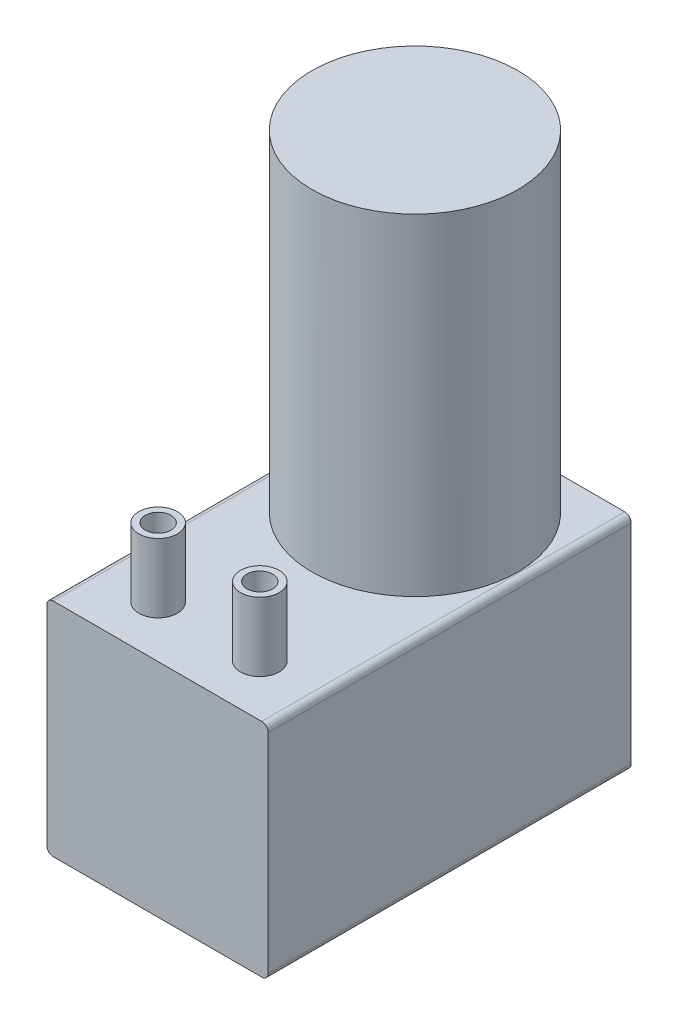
ISO-10303-21;
HEADER;
FILE_DESCRIPTION(('STEP AP214'),'2;1');
FILE_NAME('part.step','',(''),(''),'','','');
FILE_SCHEMA(('AUTOMOTIVE_DESIGN { 1 0 10303 214 1 1 1 1 }'));
ENDSEC;
DATA;
#1=APPLICATION_CONTEXT('core data for automotive mechanical design processes');
#2=APPLICATION_PROTOCOL_DEFINITION('international standard','automotive_design',2000,#1);
#3=PRODUCT_CONTEXT('',#1,'mechanical');
#4=PRODUCT('Part','Part','',(#3));
#5=PRODUCT_RELATED_PRODUCT_CATEGORY('part','',(#4));
#6=PRODUCT_DEFINITION_FORMATION('','',#4);
#7=PRODUCT_DEFINITION_CONTEXT('part definition',#1,'design');
#8=PRODUCT_DEFINITION('design','',#6,#7);
#9=PRODUCT_DEFINITION_SHAPE('','',#8);
#10=(LENGTH_UNIT() NAMED_UNIT(*) SI_UNIT(.MILLI.,.METRE.));
#11=(NAMED_UNIT(*) PLANE_ANGLE_UNIT() SI_UNIT($,.RADIAN.));
#12=(NAMED_UNIT(*) SI_UNIT($,.STERADIAN.) SOLID_ANGLE_UNIT());
#13=UNCERTAINTY_MEASURE_WITH_UNIT(LENGTH_MEASURE(1.E-05),#10,'distance_accuracy_value','');
#14=(GEOMETRIC_REPRESENTATION_CONTEXT(3) GLOBAL_UNCERTAINTY_ASSIGNED_CONTEXT((#13)) GLOBAL_UNIT_ASSIGNED_CONTEXT((#10,
#11,#12)) REPRESENTATION_CONTEXT('',''));
#15=CARTESIAN_POINT('',(0.,0.,0.));
#16=DIRECTION('',(0.,0.,1.));
#17=DIRECTION('',(1.,0.,0.));
#18=AXIS2_PLACEMENT_3D('',#15,#16,#17);
#19=CARTESIAN_POINT('',(0.5,0.5,28.2));
#20=DIRECTION('',(0.,0.,1.));
#21=DIRECTION('',(1.,0.,0.));
#22=AXIS2_PLACEMENT_3D('',#19,#20,#21);
#23=CYLINDRICAL_SURFACE('',#22,0.5);
#24=DIRECTION('',(0.,0.,1.));
#25=VECTOR('',#24,1.);
#26=CARTESIAN_POINT('',(0.,0.5,28.2));
#27=LINE('',#26,#25);
#28=CARTESIAN_POINT('',(0.,0.5,0.));
#29=VERTEX_POINT('',#28);
#30=CARTESIAN_POINT('',(0.,0.5,28.2));
#31=VERTEX_POINT('',#30);
#32=EDGE_CURVE('E151',#29,#31,#27,.T.);
#33=ORIENTED_EDGE('',*,*,#32,.F.);
#34=CARTESIAN_POINT('',(0.5,0.5,0.));
#35=DIRECTION('',(0.,0.,-1.));
#36=DIRECTION('',(-1.,0.,0.));
#37=AXIS2_PLACEMENT_3D('',#34,#35,#36);
#38=CIRCLE('',#37,0.5);
#39=CARTESIAN_POINT('',(0.5,0.,0.));
#40=VERTEX_POINT('',#39);
#41=EDGE_CURVE('E40',#40,#29,#38,.T.);
#42=ORIENTED_EDGE('',*,*,#41,.F.);
#43=DIRECTION('',(0.,0.,1.));
#44=VECTOR('',#43,1.);
#45=CARTESIAN_POINT('',(0.5,0.,28.2));
#46=LINE('',#45,#44);
#47=CARTESIAN_POINT('',(0.5,0.,28.2));
#48=VERTEX_POINT('',#47);
#49=EDGE_CURVE('E154',#48,#40,#46,.F.);
#50=ORIENTED_EDGE('',*,*,#49,.F.);
#51=CARTESIAN_POINT('',(0.5,0.5,28.2));
#52=DIRECTION('',(0.,0.,-1.));
#53=DIRECTION('',(-1.,0.,0.));
#54=AXIS2_PLACEMENT_3D('',#51,#52,#53);
#55=CIRCLE('',#54,0.5);
#56=EDGE_CURVE('E11',#31,#48,#55,.F.);
#57=ORIENTED_EDGE('',*,*,#56,.F.);
#58=EDGE_LOOP('',(#33,#42,#50,#57));
#59=FACE_BOUND('',#58,.T.);
#60=ADVANCED_FACE('F33',(#59),#23,.T.);
#61=CARTESIAN_POINT('',(16.7,0.5,28.2));
#62=DIRECTION('',(0.,0.,-1.));
#63=DIRECTION('',(-1.,0.,0.));
#64=AXIS2_PLACEMENT_3D('',#61,#62,#63);
#65=CYLINDRICAL_SURFACE('',#64,0.5);
#66=DIRECTION('',(0.,0.,-1.));
#67=VECTOR('',#66,1.);
#68=CARTESIAN_POINT('',(17.2,0.5,28.2));
#69=LINE('',#68,#67);
#70=CARTESIAN_POINT('',(17.2,0.5,28.2));
#71=VERTEX_POINT('',#70);
#72=CARTESIAN_POINT('',(17.2,0.5,0.));
#73=VERTEX_POINT('',#72);
#74=EDGE_CURVE('E140',#71,#73,#69,.T.);
#75=ORIENTED_EDGE('',*,*,#74,.F.);
#76=CARTESIAN_POINT('',(16.7,0.5,28.2));
#77=DIRECTION('',(0.,0.,-1.));
#78=DIRECTION('',(-1.,0.,0.));
#79=AXIS2_PLACEMENT_3D('',#76,#77,#78);
#80=CIRCLE('',#79,0.5);
#81=CARTESIAN_POINT('',(16.7,0.,28.2));
#82=VERTEX_POINT('',#81);
#83=EDGE_CURVE('E146',#82,#71,#80,.F.);
#84=ORIENTED_EDGE('',*,*,#83,.F.);
#85=DIRECTION('',(0.,0.,-1.));
#86=VECTOR('',#85,1.);
#87=CARTESIAN_POINT('',(16.7,0.,28.2));
#88=LINE('',#87,#86);
#89=CARTESIAN_POINT('',(16.7,0.,0.));
#90=VERTEX_POINT('',#89);
#91=EDGE_CURVE('E143',#90,#82,#88,.F.);
#92=ORIENTED_EDGE('',*,*,#91,.F.);
#93=CARTESIAN_POINT('',(16.7,0.5,0.));
#94=DIRECTION('',(0.,0.,-1.));
#95=DIRECTION('',(-1.,0.,0.));
#96=AXIS2_PLACEMENT_3D('',#93,#94,#95);
#97=CIRCLE('',#96,0.5);
#98=EDGE_CURVE('E148',#73,#90,#97,.T.);
#99=ORIENTED_EDGE('',*,*,#98,.F.);
#100=EDGE_LOOP('',(#75,#84,#92,#99));
#101=FACE_BOUND('',#100,.T.);
#102=ADVANCED_FACE('F195',(#101),#65,.T.);
#103=CARTESIAN_POINT('',(16.7,16.7,28.2));
#104=DIRECTION('',(0.,0.,-1.));
#105=DIRECTION('',(-1.,0.,0.));
#106=AXIS2_PLACEMENT_3D('',#103,#104,#105);
#107=CYLINDRICAL_SURFACE('',#106,0.5);
#108=DIRECTION('',(0.,0.,-1.));
#109=VECTOR('',#108,1.);
#110=CARTESIAN_POINT('',(16.7,17.2,28.2));
#111=LINE('',#110,#109);
#112=CARTESIAN_POINT('',(16.7,17.2,28.2));
#113=VERTEX_POINT('',#112);
#114=CARTESIAN_POINT('',(16.7,17.2,0.));
#115=VERTEX_POINT('',#114);
#116=EDGE_CURVE('E103',#113,#115,#111,.T.);
#117=ORIENTED_EDGE('',*,*,#116,.F.);
#118=CARTESIAN_POINT('',(16.7,16.7,28.2));
#119=DIRECTION('',(0.,0.,-1.));
#120=DIRECTION('',(-1.,0.,0.));
#121=AXIS2_PLACEMENT_3D('',#118,#119,#120);
#122=CIRCLE('',#121,0.5);
#123=CARTESIAN_POINT('',(17.2,16.7,28.2));
#124=VERTEX_POINT('',#123);
#125=EDGE_CURVE('E136',#124,#113,#122,.F.);
#126=ORIENTED_EDGE('',*,*,#125,.F.);
#127=DIRECTION('',(0.,0.,-1.));
#128=VECTOR('',#127,1.);
#129=CARTESIAN_POINT('',(17.2,16.7,28.2));
#130=LINE('',#129,#128);
#131=CARTESIAN_POINT('',(17.2,16.7,0.));
#132=VERTEX_POINT('',#131);
#133=EDGE_CURVE('E133',#132,#124,#130,.F.);
#134=ORIENTED_EDGE('',*,*,#133,.F.);
#135=CARTESIAN_POINT('',(16.7,16.7,0.));
#136=DIRECTION('',(0.,0.,-1.));
#137=DIRECTION('',(-1.,0.,0.));
#138=AXIS2_PLACEMENT_3D('',#135,#136,#137);
#139=CIRCLE('',#138,0.5);
#140=EDGE_CURVE('E138',#115,#132,#139,.T.);
#141=ORIENTED_EDGE('',*,*,#140,.F.);
#142=EDGE_LOOP('',(#117,#126,#134,#141));
#143=FACE_BOUND('',#142,.T.);
#144=ADVANCED_FACE('F190',(#143),#107,.T.);
#145=CARTESIAN_POINT('',(0.5,16.7,28.2));
#146=DIRECTION('',(0.,0.,1.));
#147=DIRECTION('',(1.,0.,0.));
#148=AXIS2_PLACEMENT_3D('',#145,#146,#147);
#149=CYLINDRICAL_SURFACE('',#148,0.5);
#150=DIRECTION('',(0.,0.,1.));
#151=VECTOR('',#150,1.);
#152=CARTESIAN_POINT('',(0.5,17.2,28.2));
#153=LINE('',#152,#151);
#154=CARTESIAN_POINT('',(0.5,17.2,0.));
#155=VERTEX_POINT('',#154);
#156=CARTESIAN_POINT('',(0.5,17.2,28.2));
#157=VERTEX_POINT('',#156);
#158=EDGE_CURVE('E101',#155,#157,#153,.T.);
#159=ORIENTED_EDGE('',*,*,#158,.F.);
#160=CARTESIAN_POINT('',(0.5,16.7,0.));
#161=DIRECTION('',(0.,0.,-1.));
#162=DIRECTION('',(-1.,0.,0.));
#163=AXIS2_PLACEMENT_3D('',#160,#161,#162);
#164=CIRCLE('',#163,0.5);
#165=CARTESIAN_POINT('',(0.,16.7,0.));
#166=VERTEX_POINT('',#165);
#167=EDGE_CURVE('E110',#166,#155,#164,.T.);
#168=ORIENTED_EDGE('',*,*,#167,.F.);
#169=DIRECTION('',(0.,0.,1.));
#170=VECTOR('',#169,1.);
#171=CARTESIAN_POINT('',(0.,16.7,28.2));
#172=LINE('',#171,#170);
#173=CARTESIAN_POINT('',(0.,16.7,28.2));
#174=VERTEX_POINT('',#173);
#175=EDGE_CURVE('E119',#174,#166,#172,.F.);
#176=ORIENTED_EDGE('',*,*,#175,.F.);
#177=CARTESIAN_POINT('',(0.5,16.7,28.2));
#178=DIRECTION('',(0.,0.,-1.));
#179=DIRECTION('',(-1.,0.,0.));
#180=AXIS2_PLACEMENT_3D('',#177,#178,#179);
#181=CIRCLE('',#180,0.5);
#182=EDGE_CURVE('E118',#157,#174,#181,.F.);
#183=ORIENTED_EDGE('',*,*,#182,.F.);
#184=EDGE_LOOP('',(#159,#168,#176,#183));
#185=FACE_BOUND('',#184,.T.);
#186=ADVANCED_FACE('F122',(#185),#149,.T.);
#187=CARTESIAN_POINT('',(0.,17.2,28.2));
#188=DIRECTION('',(0.,-1.,0.));
#189=DIRECTION('',(0.,0.,-1.));
#190=AXIS2_PLACEMENT_3D('',#187,#188,#189);
#191=PLANE('',#190);
#192=CARTESIAN_POINT('',(12.55,17.2,24.2));
#193=DIRECTION('',(0.,-1.,0.));
#194=DIRECTION('',(0.,0.,-1.));
#195=AXIS2_PLACEMENT_3D('',#192,#193,#194);
#196=CIRCLE('',#195,1.5);
#197=CARTESIAN_POINT('',(12.55,17.2,22.7));
#198=VERTEX_POINT('',#197);
#199=EDGE_CURVE('E127',#198,#198,#196,.F.);
#200=ORIENTED_EDGE('',*,*,#199,.F.);
#201=EDGE_LOOP('',(#200));
#202=FACE_BOUND('',#201,.T.);
#203=DIRECTION('',(-1.,0.,0.));
#204=VECTOR('',#203,1.);
#205=CARTESIAN_POINT('',(0.,17.2,28.2));
#206=LINE('',#205,#204);
#207=EDGE_CURVE('E173',#113,#157,#206,.T.);
#208=ORIENTED_EDGE('',*,*,#207,.F.);
#209=ORIENTED_EDGE('',*,*,#116,.T.);
#210=DIRECTION('',(-1.,0.,0.));
#211=VECTOR('',#210,1.);
#212=CARTESIAN_POINT('',(0.,17.2,0.));
#213=LINE('',#212,#211);
#214=EDGE_CURVE('E95',#115,#155,#213,.T.);
#215=ORIENTED_EDGE('',*,*,#214,.T.);
#216=ORIENTED_EDGE('',*,*,#158,.T.);
#217=EDGE_LOOP('',(#208,#209,#215,#216));
#218=FACE_BOUND('',#217,.T.);
#219=CARTESIAN_POINT('',(8.6,17.2,8.2));
#220=DIRECTION('',(0.,-1.,0.));
#221=DIRECTION('',(0.,0.,-1.));
#222=AXIS2_PLACEMENT_3D('',#219,#220,#221);
#223=CIRCLE('',#222,8.);
#224=CARTESIAN_POINT('',(8.6,17.2,0.199999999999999));
#225=VERTEX_POINT('',#224);
#226=EDGE_CURVE('E175',#225,#225,#223,.F.);
#227=ORIENTED_EDGE('',*,*,#226,.F.);
#228=EDGE_LOOP('',(#227));
#229=FACE_BOUND('',#228,.T.);
#230=CARTESIAN_POINT('',(4.65,17.2,24.2));
#231=DIRECTION('',(0.,-1.,0.));
#232=DIRECTION('',(0.,0.,-1.));
#233=AXIS2_PLACEMENT_3D('',#230,#231,#232);
#234=CIRCLE('',#233,1.5);
#235=CARTESIAN_POINT('',(4.65,17.2,22.7));
#236=VERTEX_POINT('',#235);
#237=EDGE_CURVE('E123',#236,#236,#234,.F.);
#238=ORIENTED_EDGE('',*,*,#237,.F.);
#239=EDGE_LOOP('',(#238));
#240=FACE_BOUND('',#239,.T.);
#241=ADVANCED_FACE('F98',(#202,#218,#229,#240),#191,.F.);
#242=CARTESIAN_POINT('',(0.,0.,28.2));
#243=DIRECTION('',(1.,0.,0.));
#244=DIRECTION('',(0.,0.,-1.));
#245=AXIS2_PLACEMENT_3D('',#242,#243,#244);
#246=PLANE('',#245);
#247=DIRECTION('',(0.,-1.,0.));
#248=VECTOR('',#247,1.);
#249=CARTESIAN_POINT('',(0.,0.,0.));
#250=LINE('',#249,#248);
#251=EDGE_CURVE('E114',#166,#29,#250,.T.);
#252=ORIENTED_EDGE('',*,*,#251,.T.);
#253=ORIENTED_EDGE('',*,*,#32,.T.);
#254=DIRECTION('',(0.,-1.,0.));
#255=VECTOR('',#254,1.);
#256=CARTESIAN_POINT('',(0.,0.,28.2));
#257=LINE('',#256,#255);
#258=EDGE_CURVE('E106',#174,#31,#257,.T.);
#259=ORIENTED_EDGE('',*,*,#258,.F.);
#260=ORIENTED_EDGE('',*,*,#175,.T.);
#261=EDGE_LOOP('',(#252,#253,#259,#260));
#262=FACE_BOUND('',#261,.T.);
#263=ADVANCED_FACE('F158',(#262),#246,.F.);
#264=CARTESIAN_POINT('',(0.,0.,28.2));
#265=DIRECTION('',(0.,1.,0.));
#266=DIRECTION('',(0.,0.,1.));
#267=AXIS2_PLACEMENT_3D('',#264,#265,#266);
#268=PLANE('',#267);
#269=DIRECTION('',(1.,0.,0.));
#270=VECTOR('',#269,1.);
#271=CARTESIAN_POINT('',(0.,0.,28.2));
#272=LINE('',#271,#270);
#273=EDGE_CURVE('E169',#48,#82,#272,.T.);
#274=ORIENTED_EDGE('',*,*,#273,.F.);
#275=ORIENTED_EDGE('',*,*,#49,.T.);
#276=DIRECTION('',(1.,0.,0.));
#277=VECTOR('',#276,1.);
#278=CARTESIAN_POINT('',(0.,0.,0.));
#279=LINE('',#278,#277);
#280=EDGE_CURVE('E155',#40,#90,#279,.T.);
#281=ORIENTED_EDGE('',*,*,#280,.T.);
#282=ORIENTED_EDGE('',*,*,#91,.T.);
#283=EDGE_LOOP('',(#274,#275,#281,#282));
#284=FACE_BOUND('',#283,.T.);
#285=ADVANCED_FACE('F188',(#284),#268,.F.);
#286=CARTESIAN_POINT('',(17.2,0.,28.2));
#287=DIRECTION('',(-1.,0.,0.));
#288=DIRECTION('',(0.,0.,1.));
#289=AXIS2_PLACEMENT_3D('',#286,#287,#288);
#290=PLANE('',#289);
#291=DIRECTION('',(0.,1.,0.));
#292=VECTOR('',#291,1.);
#293=CARTESIAN_POINT('',(17.2,0.,28.2));
#294=LINE('',#293,#292);
#295=EDGE_CURVE('E171',#71,#124,#294,.T.);
#296=ORIENTED_EDGE('',*,*,#295,.F.);
#297=ORIENTED_EDGE('',*,*,#74,.T.);
#298=DIRECTION('',(0.,1.,0.));
#299=VECTOR('',#298,1.);
#300=CARTESIAN_POINT('',(17.2,0.,0.));
#301=LINE('',#300,#299);
#302=EDGE_CURVE('E107',#73,#132,#301,.T.);
#303=ORIENTED_EDGE('',*,*,#302,.T.);
#304=ORIENTED_EDGE('',*,*,#133,.T.);
#305=EDGE_LOOP('',(#296,#297,#303,#304));
#306=FACE_BOUND('',#305,.T.);
#307=ADVANCED_FACE('F208',(#306),#290,.F.);
#308=CARTESIAN_POINT('',(0.,17.2,28.2));
#309=DIRECTION('',(0.,0.,-1.));
#310=DIRECTION('',(-1.,0.,0.));
#311=AXIS2_PLACEMENT_3D('',#308,#309,#310);
#312=PLANE('',#311);
#313=ORIENTED_EDGE('',*,*,#258,.T.);
#314=ORIENTED_EDGE('',*,*,#56,.T.);
#315=ORIENTED_EDGE('',*,*,#273,.T.);
#316=ORIENTED_EDGE('',*,*,#83,.T.);
#317=ORIENTED_EDGE('',*,*,#295,.T.);
#318=ORIENTED_EDGE('',*,*,#125,.T.);
#319=ORIENTED_EDGE('',*,*,#207,.T.);
#320=ORIENTED_EDGE('',*,*,#182,.T.);
#321=EDGE_LOOP('',(#313,#314,#315,#316,#317,#318,#319,#320));
#322=FACE_BOUND('',#321,.T.);
#323=ADVANCED_FACE('F211',(#322),#312,.F.);
#324=CARTESIAN_POINT('',(0.,17.2,0.));
#325=DIRECTION('',(0.,0.,-1.));
#326=DIRECTION('',(-1.,0.,0.));
#327=AXIS2_PLACEMENT_3D('',#324,#325,#326);
#328=PLANE('',#327);
#329=ORIENTED_EDGE('',*,*,#280,.F.);
#330=ORIENTED_EDGE('',*,*,#41,.T.);
#331=ORIENTED_EDGE('',*,*,#251,.F.);
#332=ORIENTED_EDGE('',*,*,#167,.T.);
#333=ORIENTED_EDGE('',*,*,#214,.F.);
#334=ORIENTED_EDGE('',*,*,#140,.T.);
#335=ORIENTED_EDGE('',*,*,#302,.F.);
#336=ORIENTED_EDGE('',*,*,#98,.T.);
#337=EDGE_LOOP('',(#329,#330,#331,#332,#333,#334,#335,#336));
#338=FACE_BOUND('',#337,.T.);
#339=ADVANCED_FACE('F112',(#338),#328,.T.);
#340=CARTESIAN_POINT('',(8.6,42.93,8.2));
#341=DIRECTION('',(0.,-1.,0.));
#342=DIRECTION('',(0.,0.,-1.));
#343=AXIS2_PLACEMENT_3D('',#340,#341,#342);
#344=CYLINDRICAL_SURFACE('',#343,8.);
#345=CARTESIAN_POINT('',(8.6,42.93,8.2));
#346=DIRECTION('',(0.,1.,0.));
#347=DIRECTION('',(0.,0.,1.));
#348=AXIS2_PLACEMENT_3D('',#345,#346,#347);
#349=CIRCLE('',#348,8.);
#350=CARTESIAN_POINT('',(8.6,42.93,16.2));
#351=VERTEX_POINT('',#350);
#352=EDGE_CURVE('E159',#351,#351,#349,.T.);
#353=ORIENTED_EDGE('',*,*,#352,.F.);
#354=EDGE_LOOP('',(#353));
#355=FACE_BOUND('',#354,.T.);
#356=ORIENTED_EDGE('',*,*,#226,.T.);
#357=EDGE_LOOP('',(#356));
#358=FACE_BOUND('',#357,.T.);
#359=ADVANCED_FACE('F226',(#355,#358),#344,.T.);
#360=CARTESIAN_POINT('',(8.6,42.93,8.2));
#361=DIRECTION('',(0.,1.,0.));
#362=DIRECTION('',(0.,0.,1.));
#363=AXIS2_PLACEMENT_3D('',#360,#361,#362);
#364=PLANE('',#363);
#365=ORIENTED_EDGE('',*,*,#352,.T.);
#366=EDGE_LOOP('',(#365));
#367=FACE_BOUND('',#366,.T.);
#368=ADVANCED_FACE('F231',(#367),#364,.T.);
#369=CARTESIAN_POINT('',(12.55,22.54,24.2));
#370=DIRECTION('',(0.,-1.,0.));
#371=DIRECTION('',(0.,0.,-1.));
#372=AXIS2_PLACEMENT_3D('',#369,#370,#371);
#373=CYLINDRICAL_SURFACE('',#372,1.5);
#374=CARTESIAN_POINT('',(12.55,22.54,24.2));
#375=DIRECTION('',(0.,1.,0.));
#376=DIRECTION('',(0.,0.,1.));
#377=AXIS2_PLACEMENT_3D('',#374,#375,#376);
#378=CIRCLE('',#377,1.5);
#379=CARTESIAN_POINT('',(12.55,22.54,22.7));
#380=VERTEX_POINT('',#379);
#381=EDGE_CURVE('E163',#380,#380,#378,.T.);
#382=CARTESIAN_POINT('',(12.55,22.54,22.7));
#383=CARTESIAN_POINT('',(12.55,22.484375,22.7));
#384=CARTESIAN_POINT('',(12.55,22.42875,22.7));
#385=CARTESIAN_POINT('',(12.55,22.3175,22.7));
#386=CARTESIAN_POINT('',(12.55,22.261875,22.7));
#387=CARTESIAN_POINT('',(12.55,22.150625,22.7));
#388=CARTESIAN_POINT('',(12.55,22.095,22.7));
#389=CARTESIAN_POINT('',(12.55,21.98375,22.7));
#390=CARTESIAN_POINT('',(12.55,21.928125,22.7));
#391=CARTESIAN_POINT('',(12.55,21.816875,22.7));
#392=CARTESIAN_POINT('',(12.55,21.76125,22.7));
#393=CARTESIAN_POINT('',(12.55,21.65,22.7));
#394=CARTESIAN_POINT('',(12.55,21.594375,22.7));
#395=CARTESIAN_POINT('',(12.55,21.483125,22.7));
#396=CARTESIAN_POINT('',(12.55,21.4275,22.7));
#397=CARTESIAN_POINT('',(12.55,21.31625,22.7));
#398=CARTESIAN_POINT('',(12.55,21.260625,22.7));
#399=CARTESIAN_POINT('',(12.55,21.149375,22.7));
#400=CARTESIAN_POINT('',(12.55,21.09375,22.7));
#401=CARTESIAN_POINT('',(12.55,20.9825,22.7));
#402=CARTESIAN_POINT('',(12.55,20.926875,22.7));
#403=CARTESIAN_POINT('',(12.55,20.815625,22.7));
#404=CARTESIAN_POINT('',(12.55,20.76,22.7));
#405=CARTESIAN_POINT('',(12.55,20.64875,22.7));
#406=CARTESIAN_POINT('',(12.55,20.593125,22.7));
#407=CARTESIAN_POINT('',(12.55,20.481875,22.7));
#408=CARTESIAN_POINT('',(12.55,20.42625,22.7));
#409=CARTESIAN_POINT('',(12.55,20.315,22.7));
#410=CARTESIAN_POINT('',(12.55,20.259375,22.7));
#411=CARTESIAN_POINT('',(12.55,20.148125,22.7));
#412=CARTESIAN_POINT('',(12.55,20.0925,22.7));
#413=CARTESIAN_POINT('',(12.55,19.98125,22.7));
#414=CARTESIAN_POINT('',(12.55,19.925625,22.7));
#415=CARTESIAN_POINT('',(12.55,19.814375,22.7));
#416=CARTESIAN_POINT('',(12.55,19.75875,22.7));
#417=CARTESIAN_POINT('',(12.55,19.6475,22.7));
#418=CARTESIAN_POINT('',(12.55,19.591875,22.7));
#419=CARTESIAN_POINT('',(12.55,19.480625,22.7));
#420=CARTESIAN_POINT('',(12.55,19.425,22.7));
#421=CARTESIAN_POINT('',(12.55,19.31375,22.7));
#422=CARTESIAN_POINT('',(12.55,19.258125,22.7));
#423=CARTESIAN_POINT('',(12.55,19.146875,22.7));
#424=CARTESIAN_POINT('',(12.55,19.09125,22.7));
#425=CARTESIAN_POINT('',(12.55,18.98,22.7));
#426=CARTESIAN_POINT('',(12.55,18.924375,22.7));
#427=CARTESIAN_POINT('',(12.55,18.813125,22.7));
#428=CARTESIAN_POINT('',(12.55,18.7575,22.7));
#429=CARTESIAN_POINT('',(12.55,18.64625,22.7));
#430=CARTESIAN_POINT('',(12.55,18.590625,22.7));
#431=CARTESIAN_POINT('',(12.55,18.479375,22.7));
#432=CARTESIAN_POINT('',(12.55,18.42375,22.7));
#433=CARTESIAN_POINT('',(12.55,18.3125,22.7));
#434=CARTESIAN_POINT('',(12.55,18.256875,22.7));
#435=CARTESIAN_POINT('',(12.55,18.145625,22.7));
#436=CARTESIAN_POINT('',(12.55,18.09,22.7));
#437=CARTESIAN_POINT('',(12.55,17.97875,22.7));
#438=CARTESIAN_POINT('',(12.55,17.923125,22.7));
#439=CARTESIAN_POINT('',(12.55,17.811875,22.7));
#440=CARTESIAN_POINT('',(12.55,17.75625,22.7));
#441=CARTESIAN_POINT('',(12.55,17.645,22.7));
#442=CARTESIAN_POINT('',(12.55,17.589375,22.7));
#443=CARTESIAN_POINT('',(12.55,17.478125,22.7));
#444=CARTESIAN_POINT('',(12.55,17.4225,22.7));
#445=CARTESIAN_POINT('',(12.55,17.31125,22.7));
#446=CARTESIAN_POINT('',(12.55,17.255625,22.7));
#447=CARTESIAN_POINT('',(12.55,17.2,22.7));
#448=B_SPLINE_CURVE_WITH_KNOTS('',3,(#382,#383,#384,#385,#386,#387,#388,#389,#390,#391,#392,
#393,#394,#395,#396,#397,#398,#399,#400,#401,#402,#403,#404,#405,#406,#407,#408,#409,#410,#411,
#412,#413,#414,#415,#416,#417,#418,#419,#420,#421,#422,#423,#424,#425,#426,#427,#428,#429,#430,
#431,#432,#433,#434,#435,#436,#437,#438,#439,#440,#441,#442,#443,#444,#445,#446,#447),
.UNSPECIFIED.,.F.,.F.,(4,2,2,2,2,2,2,2,2,2,2,2,2,2,2,2,2,2,2,2,2,2,2,2,2,2,2,2,2,2,2,2,4),(0.,
0.166875,0.333750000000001,0.500625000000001,0.667500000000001,0.834375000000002,1.00125,
1.168125,1.335,1.501875,1.66875,1.835625,2.0025,2.169375,2.33625,2.503125,2.67,2.836875,3.00375,
3.170625,3.3375,3.504375,3.67125,3.838125,4.005,4.171875,4.33875,4.505625,4.6725,4.839375,
5.00625,5.173125,5.34),.UNSPECIFIED.);
#449=EDGE_CURVE('BSEAM180',#380,#198,#448,.T.);
#450=ORIENTED_EDGE('',*,*,#381,.F.);
#451=ORIENTED_EDGE('',*,*,#199,.T.);
#452=ORIENTED_EDGE('',*,*,#449,.T.);
#453=ORIENTED_EDGE('',*,*,#449,.F.);
#454=EDGE_LOOP('',(#450,#452,#451,#453));
#455=FACE_BOUND('',#454,.T.);
#456=ADVANCED_FACE('F180',(#455),#373,.T.);
#457=CARTESIAN_POINT('',(12.55,22.54,24.2));
#458=DIRECTION('',(0.,1.,0.));
#459=DIRECTION('',(0.,0.,1.));
#460=AXIS2_PLACEMENT_3D('',#457,#458,#459);
#461=PLANE('',#460);
#462=CARTESIAN_POINT('',(12.55,22.54,24.2));
#463=DIRECTION('',(0.,1.,0.));
#464=DIRECTION('',(0.,0.,1.));
#465=AXIS2_PLACEMENT_3D('',#462,#463,#464);
#466=CIRCLE('',#465,1.);
#467=CARTESIAN_POINT('',(12.55,22.54,25.2));
#468=VERTEX_POINT('',#467);
#469=EDGE_CURVE('E275',#468,#468,#466,.T.);
#470=ORIENTED_EDGE('',*,*,#469,.F.);
#471=EDGE_LOOP('',(#470));
#472=FACE_BOUND('',#471,.T.);
#473=ORIENTED_EDGE('',*,*,#381,.T.);
#474=EDGE_LOOP('',(#473));
#475=FACE_BOUND('',#474,.T.);
#476=ADVANCED_FACE('F238',(#472,#475),#461,.T.);
#477=CARTESIAN_POINT('',(4.65,22.54,24.2));
#478=DIRECTION('',(0.,-1.,0.));
#479=DIRECTION('',(0.,0.,-1.));
#480=AXIS2_PLACEMENT_3D('',#477,#478,#479);
#481=CYLINDRICAL_SURFACE('',#480,1.5);
#482=CARTESIAN_POINT('',(4.65,22.54,24.2));
#483=DIRECTION('',(0.,1.,0.));
#484=DIRECTION('',(0.,0.,1.));
#485=AXIS2_PLACEMENT_3D('',#482,#483,#484);
#486=CIRCLE('',#485,1.5);
#487=CARTESIAN_POINT('',(4.65,22.54,22.7));
#488=VERTEX_POINT('',#487);
#489=EDGE_CURVE('E284',#488,#488,#486,.T.);
#490=CARTESIAN_POINT('',(4.65,22.54,22.7));
#491=CARTESIAN_POINT('',(4.65,22.484375,22.7));
#492=CARTESIAN_POINT('',(4.65,22.42875,22.7));
#493=CARTESIAN_POINT('',(4.65,22.3175,22.7));
#494=CARTESIAN_POINT('',(4.65,22.261875,22.7));
#495=CARTESIAN_POINT('',(4.65,22.150625,22.7));
#496=CARTESIAN_POINT('',(4.65,22.095,22.7));
#497=CARTESIAN_POINT('',(4.65,21.98375,22.7));
#498=CARTESIAN_POINT('',(4.65,21.928125,22.7));
#499=CARTESIAN_POINT('',(4.65,21.816875,22.7));
#500=CARTESIAN_POINT('',(4.65,21.76125,22.7));
#501=CARTESIAN_POINT('',(4.65,21.65,22.7));
#502=CARTESIAN_POINT('',(4.65,21.594375,22.7));
#503=CARTESIAN_POINT('',(4.65,21.483125,22.7));
#504=CARTESIAN_POINT('',(4.65,21.4275,22.7));
#505=CARTESIAN_POINT('',(4.65,21.31625,22.7));
#506=CARTESIAN_POINT('',(4.65,21.260625,22.7));
#507=CARTESIAN_POINT('',(4.65,21.149375,22.7));
#508=CARTESIAN_POINT('',(4.65,21.09375,22.7));
#509=CARTESIAN_POINT('',(4.65,20.9825,22.7));
#510=CARTESIAN_POINT('',(4.65,20.926875,22.7));
#511=CARTESIAN_POINT('',(4.65,20.815625,22.7));
#512=CARTESIAN_POINT('',(4.65,20.76,22.7));
#513=CARTESIAN_POINT('',(4.65,20.64875,22.7));
#514=CARTESIAN_POINT('',(4.65,20.593125,22.7));
#515=CARTESIAN_POINT('',(4.65,20.481875,22.7));
#516=CARTESIAN_POINT('',(4.65,20.42625,22.7));
#517=CARTESIAN_POINT('',(4.65,20.315,22.7));
#518=CARTESIAN_POINT('',(4.65,20.259375,22.7));
#519=CARTESIAN_POINT('',(4.65,20.148125,22.7));
#520=CARTESIAN_POINT('',(4.65,20.0925,22.7));
#521=CARTESIAN_POINT('',(4.65,19.98125,22.7));
#522=CARTESIAN_POINT('',(4.65,19.925625,22.7));
#523=CARTESIAN_POINT('',(4.65,19.814375,22.7));
#524=CARTESIAN_POINT('',(4.65,19.75875,22.7));
#525=CARTESIAN_POINT('',(4.65,19.6475,22.7));
#526=CARTESIAN_POINT('',(4.65,19.591875,22.7));
#527=CARTESIAN_POINT('',(4.65,19.480625,22.7));
#528=CARTESIAN_POINT('',(4.65,19.425,22.7));
#529=CARTESIAN_POINT('',(4.65,19.31375,22.7));
#530=CARTESIAN_POINT('',(4.65,19.258125,22.7));
#531=CARTESIAN_POINT('',(4.65,19.146875,22.7));
#532=CARTESIAN_POINT('',(4.65,19.09125,22.7));
#533=CARTESIAN_POINT('',(4.65,18.98,22.7));
#534=CARTESIAN_POINT('',(4.65,18.924375,22.7));
#535=CARTESIAN_POINT('',(4.65,18.813125,22.7));
#536=CARTESIAN_POINT('',(4.65,18.7575,22.7));
#537=CARTESIAN_POINT('',(4.65,18.64625,22.7));
#538=CARTESIAN_POINT('',(4.65,18.590625,22.7));
#539=CARTESIAN_POINT('',(4.65,18.479375,22.7));
#540=CARTESIAN_POINT('',(4.65,18.42375,22.7));
#541=CARTESIAN_POINT('',(4.65,18.3125,22.7));
#542=CARTESIAN_POINT('',(4.65,18.256875,22.7));
#543=CARTESIAN_POINT('',(4.65,18.145625,22.7));
#544=CARTESIAN_POINT('',(4.65,18.09,22.7));
#545=CARTESIAN_POINT('',(4.65,17.97875,22.7));
#546=CARTESIAN_POINT('',(4.65,17.923125,22.7));
#547=CARTESIAN_POINT('',(4.65,17.811875,22.7));
#548=CARTESIAN_POINT('',(4.65,17.75625,22.7));
#549=CARTESIAN_POINT('',(4.65,17.645,22.7));
#550=CARTESIAN_POINT('',(4.65,17.589375,22.7));
#551=CARTESIAN_POINT('',(4.65,17.478125,22.7));
#552=CARTESIAN_POINT('',(4.65,17.4225,22.7));
#553=CARTESIAN_POINT('',(4.65,17.31125,22.7));
#554=CARTESIAN_POINT('',(4.65,17.255625,22.7));
#555=CARTESIAN_POINT('',(4.65,17.2,22.7));
#556=B_SPLINE_CURVE_WITH_KNOTS('',3,(#490,#491,#492,#493,#494,#495,#496,#497,#498,#499,#500,
#501,#502,#503,#504,#505,#506,#507,#508,#509,#510,#511,#512,#513,#514,#515,#516,#517,#518,#519,
#520,#521,#522,#523,#524,#525,#526,#527,#528,#529,#530,#531,#532,#533,#534,#535,#536,#537,#538,
#539,#540,#541,#542,#543,#544,#545,#546,#547,#548,#549,#550,#551,#552,#553,#554,#555),
.UNSPECIFIED.,.F.,.F.,(4,2,2,2,2,2,2,2,2,2,2,2,2,2,2,2,2,2,2,2,2,2,2,2,2,2,2,2,2,2,2,2,4),(0.,
0.166875,0.333750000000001,0.500625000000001,0.667500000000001,0.834375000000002,1.00125,
1.168125,1.335,1.501875,1.66875,1.835625,2.0025,2.169375,2.33625,2.503125,2.67,2.836875,3.00375,
3.170625,3.3375,3.504375,3.67125,3.838125,4.005,4.171875,4.33875,4.505625,4.6725,4.839375,
5.00625,5.173125,5.34),.UNSPECIFIED.);
#557=EDGE_CURVE('BSEAM242',#488,#236,#556,.T.);
#558=ORIENTED_EDGE('',*,*,#489,.F.);
#559=ORIENTED_EDGE('',*,*,#237,.T.);
#560=ORIENTED_EDGE('',*,*,#557,.T.);
#561=ORIENTED_EDGE('',*,*,#557,.F.);
#562=EDGE_LOOP('',(#558,#560,#559,#561));
#563=FACE_BOUND('',#562,.T.);
#564=ADVANCED_FACE('F242',(#563),#481,.T.);
#565=CARTESIAN_POINT('',(4.65,22.54,24.2));
#566=DIRECTION('',(0.,1.,0.));
#567=DIRECTION('',(0.,0.,1.));
#568=AXIS2_PLACEMENT_3D('',#565,#566,#567);
#569=PLANE('',#568);
#570=CARTESIAN_POINT('',(4.65,22.54,24.2));
#571=DIRECTION('',(0.,1.,0.));
#572=DIRECTION('',(0.,0.,1.));
#573=AXIS2_PLACEMENT_3D('',#570,#571,#572);
#574=CIRCLE('',#573,1.);
#575=CARTESIAN_POINT('',(4.65,22.54,25.2));
#576=VERTEX_POINT('',#575);
#577=EDGE_CURVE('E271',#576,#576,#574,.T.);
#578=ORIENTED_EDGE('',*,*,#577,.F.);
#579=EDGE_LOOP('',(#578));
#580=FACE_BOUND('',#579,.T.);
#581=ORIENTED_EDGE('',*,*,#489,.T.);
#582=EDGE_LOOP('',(#581));
#583=FACE_BOUND('',#582,.T.);
#584=ADVANCED_FACE('F246',(#580,#583),#569,.T.);
#585=CARTESIAN_POINT('',(0.,17.2,28.2));
#586=DIRECTION('',(0.,-1.,0.));
#587=DIRECTION('',(0.,0.,-1.));
#588=AXIS2_PLACEMENT_3D('',#585,#586,#587);
#589=PLANE('',#588);
#590=CARTESIAN_POINT('',(12.55,17.2,24.2));
#591=DIRECTION('',(0.,-1.,0.));
#592=DIRECTION('',(0.,0.,-1.));
#593=AXIS2_PLACEMENT_3D('',#590,#591,#592);
#594=CIRCLE('',#593,1.);
#595=CARTESIAN_POINT('',(12.55,17.2,23.2));
#596=VERTEX_POINT('',#595);
#597=EDGE_CURVE('E278',#596,#596,#594,.F.);
#598=ORIENTED_EDGE('',*,*,#597,.T.);
#599=EDGE_LOOP('',(#598));
#600=FACE_BOUND('',#599,.T.);
#601=ADVANCED_FACE('F250',(#600),#589,.F.);
#602=CARTESIAN_POINT('',(12.55,14.3715728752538,24.2));
#603=DIRECTION('',(0.,1.,0.));
#604=DIRECTION('',(0.,0.,1.));
#605=AXIS2_PLACEMENT_3D('',#602,#603,#604);
#606=CYLINDRICAL_SURFACE('',#605,1.);
#607=ORIENTED_EDGE('',*,*,#469,.T.);
#608=EDGE_LOOP('',(#607));
#609=FACE_BOUND('',#608,.T.);
#610=ORIENTED_EDGE('',*,*,#597,.F.);
#611=EDGE_LOOP('',(#610));
#612=FACE_BOUND('',#611,.T.);
#613=ADVANCED_FACE('F254',(#609,#612),#606,.F.);
#614=CARTESIAN_POINT('',(0.,17.2,28.2));
#615=DIRECTION('',(0.,-1.,0.));
#616=DIRECTION('',(0.,0.,-1.));
#617=AXIS2_PLACEMENT_3D('',#614,#615,#616);
#618=PLANE('',#617);
#619=CARTESIAN_POINT('',(4.65,17.2,24.2));
#620=DIRECTION('',(0.,-1.,0.));
#621=DIRECTION('',(0.,0.,-1.));
#622=AXIS2_PLACEMENT_3D('',#619,#620,#621);
#623=CIRCLE('',#622,1.);
#624=CARTESIAN_POINT('',(4.65,17.2,23.2));
#625=VERTEX_POINT('',#624);
#626=EDGE_CURVE('E274',#625,#625,#623,.F.);
#627=ORIENTED_EDGE('',*,*,#626,.T.);
#628=EDGE_LOOP('',(#627));
#629=FACE_BOUND('',#628,.T.);
#630=ADVANCED_FACE('F258',(#629),#618,.F.);
#631=CARTESIAN_POINT('',(4.65,14.3715728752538,24.2));
#632=DIRECTION('',(0.,1.,0.));
#633=DIRECTION('',(0.,0.,1.));
#634=AXIS2_PLACEMENT_3D('',#631,#632,#633);
#635=CYLINDRICAL_SURFACE('',#634,1.);
#636=ORIENTED_EDGE('',*,*,#577,.T.);
#637=EDGE_LOOP('',(#636));
#638=FACE_BOUND('',#637,.T.);
#639=ORIENTED_EDGE('',*,*,#626,.F.);
#640=EDGE_LOOP('',(#639));
#641=FACE_BOUND('',#640,.T.);
#642=ADVANCED_FACE('F262',(#638,#641),#635,.F.);
#643=CLOSED_SHELL('',(#60,#102,#144,#186,#241,#263,#285,#307,#323,#339,#359,#368,#456,#476,#564,
#584,#601,#613,#630,#642));
#644=MANIFOLD_SOLID_BREP('B2',#643);
#645=ADVANCED_BREP_SHAPE_REPRESENTATION('',(#18,#644),#14);
#646=SHAPE_DEFINITION_REPRESENTATION(#9,#645);
ENDSEC;
END-ISO-10303-21;
